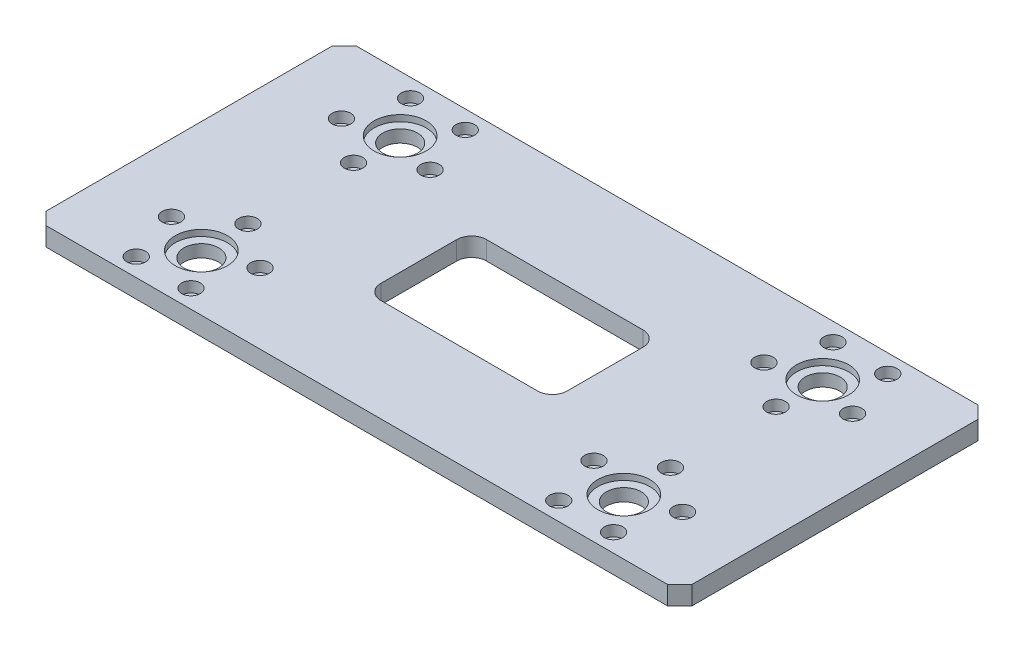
from build123d import *

# Parameters (mm, degrees)
SKETCH1_W                                           = 520
SKETCH1_H                                           = 250
BOSS_EXTRUDE1_DEPTH                                 = 15
CHAMFER1_SIZE                                       = 10
SKETCH2_R                                           = 21
CUT_EXTRUDE1_DEPTH                                  = 5
SKETCH3_R                                           = 14
CUT_EXTRUDE2_DEPTH                                  = 289.660700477
CBORE_FOR_M8_HEX_SOCKET_HEAD_CAP_SCREW1_D           = 9
CBORE_FOR_M8_HEX_SOCKET_HEAD_CAP_SCREW1_CBORE_D     = 15
CBORE_FOR_M8_HEX_SOCKET_HEAD_CAP_SCREW1_CBORE_DEPTH = 8.6
CIRPATTERN1_COUNT                                   = 5
MIRROR1_COPY_1_D                                    = 9
MIRROR1_COPY_1_CBORE_D                              = 15
MIRROR1_COPY_1_CBORE_DEPTH                          = 8.6
MIRROR1_COPY_2_D                                    = 9
MIRROR1_COPY_2_CBORE_D                              = 15
MIRROR1_COPY_2_CBORE_DEPTH                          = 8.6
MIRROR1_COPY_3_D                                    = 9
MIRROR1_COPY_3_CBORE_D                              = 15
MIRROR1_COPY_3_CBORE_DEPTH                          = 8.6
MIRROR1_COPY_4_D                                    = 9
MIRROR1_COPY_4_CBORE_D                              = 15
MIRROR1_COPY_4_CBORE_DEPTH                          = 8.6
MIRROR2_COPY_1_D                                    = 9
MIRROR2_COPY_1_CBORE_D                              = 15
MIRROR2_COPY_1_CBORE_DEPTH                          = 8.6
MIRROR2_COPY_2_D                                    = 9
MIRROR2_COPY_2_CBORE_D                              = 15
MIRROR2_COPY_2_CBORE_DEPTH                          = 8.6
MIRROR2_COPY_3_D                                    = 9
MIRROR2_COPY_3_CBORE_D                              = 15
MIRROR2_COPY_3_CBORE_DEPTH                          = 8.6
MIRROR2_COPY_4_D                                    = 9
MIRROR2_COPY_4_CBORE_D                              = 15
MIRROR2_COPY_4_CBORE_DEPTH                          = 8.6
MIRROR2_COPY_5_SKETCH_R                             = 21
MIRROR2_COPY_5_DEPTH                                = 5
MIRROR2_COPY_6_SKETCH_R                             = 14
MIRROR2_COPY_6_DEPTH                                = 289.660700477
MIRROR2_COPY_7_D                                    = 9
MIRROR2_COPY_7_CBORE_D                              = 15
MIRROR2_COPY_7_CBORE_DEPTH                          = 8.6
MIRROR2_COPY_8_D                                    = 9
MIRROR2_COPY_8_CBORE_D                              = 15
MIRROR2_COPY_8_CBORE_DEPTH                          = 8.6
MIRROR2_COPY_9_D                                    = 9
MIRROR2_COPY_9_CBORE_D                              = 15
MIRROR2_COPY_9_CBORE_DEPTH                          = 8.6
MIRROR2_COPY_10_D                                   = 9
MIRROR2_COPY_10_CBORE_D                             = 15
MIRROR2_COPY_10_CBORE_DEPTH                         = 8.6
MIRROR2_COPY_11_D                                   = 9
MIRROR2_COPY_11_CBORE_D                             = 15
MIRROR2_COPY_11_CBORE_DEPTH                         = 8.6
SKETCH6_W                                           = 150
SKETCH6_H                                           = 85
CUT_EXTRUDE7_DEPTH                                  = 289.877136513
FILLET1_R                                           = 12


with BuildPart() as part:
    # Sketch1 → Boss-Extrude1 (new body)
    with BuildSketch(Plane(origin=(0, 0, 0), x_dir=(1, 0, 0), z_dir=(0, 1, 0))):
        Rectangle(SKETCH1_W, SKETCH1_H)
    extrude(amount=BOSS_EXTRUDE1_DEPTH)

    # Chamfer1
    chamfer1_edges = [part.edges().sort_by_distance(p)[0] for p in [
        (-260, 7.5, -125),
        (260, 7.5, -125),
        (260, 7.5, 125),
        (-260, 7.5, 125),
    ]]
    chamfer(chamfer1_edges, length=CHAMFER1_SIZE)

    # Sketch2 → Cut-Extrude1 (cut)
    with BuildSketch(Plane(origin=(0, 15, 0), x_dir=(1, 0, 0), z_dir=(0, 1, 0))):
        with Locations(Location((170, -80, 0), (0, 0, 270))):
            Circle(SKETCH2_R)
    cut_extrude1 = extrude(amount=-CUT_EXTRUDE1_DEPTH, mode=Mode.SUBTRACT)

    # Sketch3 → Cut-Extrude2 (cut, through all)
    with BuildSketch(Plane(origin=(0, 10, 0), x_dir=(1, 0, 0), z_dir=(0, 1, 0))):
        with Locations(Location((170, -80, 0), (0, 0, 270))):
            Circle(SKETCH3_R)
    cut_extrude2 = extrude(amount=-CUT_EXTRUDE2_DEPTH, mode=Mode.SUBTRACT)

    # CBORE for M8 Hex Socket Head Cap Screw1 (through all)
    with Locations(Plane(origin=(0, 15, 0), x_dir=(1, 0, 0), z_dir=(0, 1, 0))):
        with Locations((170, -42.5)):
            cbore_for_m8_hex_socket_head_cap_screw1 = CounterBoreHole(CBORE_FOR_M8_HEX_SOCKET_HEAD_CAP_SCREW1_D / 2, CBORE_FOR_M8_HEX_SOCKET_HEAD_CAP_SCREW1_CBORE_D / 2, CBORE_FOR_M8_HEX_SOCKET_HEAD_CAP_SCREW1_CBORE_DEPTH)

    # CirPattern1: CBORE for M8 Hex Socket Head Cap Screw1 ×5 about axis
    cirpattern1_axis = Axis((170, 0, 80), (0, 1, 0))
    for i in range(1, CIRPATTERN1_COUNT):
        add(cbore_for_m8_hex_socket_head_cap_screw1.rotate(cirpattern1_axis, i * 360 / CIRPATTERN1_COUNT), mode=Mode.SUBTRACT)

    # Mirror1: Cut-Extrude1, Cut-Extrude2, CBORE for M8 Hex Socket Head Cap Screw1 across plane
    add(cut_extrude1.mirror(Plane.XY), mode=Mode.SUBTRACT)
    add(cut_extrude2.mirror(Plane.XY), mode=Mode.SUBTRACT)
    add(cbore_for_m8_hex_socket_head_cap_screw1.mirror(Plane.XY), mode=Mode.SUBTRACT)

    # Mirror1 copy 1 (through all)
    with Locations(Plane(origin=(41.382589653, 15, -216.95824822), x_dir=(0.30901699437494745, 0, 0.9510565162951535), z_dir=(0, 1, 0))):
        with Locations((170, 42.5)):
            CounterBoreHole(MIRROR1_COPY_1_D / 2, MIRROR1_COPY_1_CBORE_D / 2, MIRROR1_COPY_1_CBORE_DEPTH)

    # Mirror1 copy 2 (through all)
    with Locations(Plane(origin=(260.51006886, 15, -244.64485244), x_dir=(-0.8090169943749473, 0, 0.5877852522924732), z_dir=(0, 1, 0))):
        with Locations((170, 42.5)):
            CounterBoreHole(MIRROR1_COPY_2_D / 2, MIRROR1_COPY_2_CBORE_D / 2, MIRROR1_COPY_2_CBORE_DEPTH)

    # Mirror1 copy 3 (through all)
    with Locations(Plane(origin=(354.555709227, 15, -44.79786666), x_dir=(-0.8090169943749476, 0, -0.587785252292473), z_dir=(0, 1, 0))):
        with Locations((170, 42.5)):
            CounterBoreHole(MIRROR1_COPY_3_D / 2, MIRROR1_COPY_3_CBORE_D / 2, MIRROR1_COPY_3_CBORE_DEPTH)

    # Mirror1 copy 4 (through all)
    with Locations(Plane(origin=(193.55163226, 15, 106.40096732), x_dir=(0.30901699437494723, 0, -0.9510565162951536), z_dir=(0, 1, 0))):
        with Locations((170, 42.5)):
            CounterBoreHole(MIRROR1_COPY_4_D / 2, MIRROR1_COPY_4_CBORE_D / 2, MIRROR1_COPY_4_CBORE_DEPTH)

    # Mirror2: Cut-Extrude1, Cut-Extrude2, CBORE for M8 Hex Socket Head Cap Screw1 across plane
    add(cut_extrude1.mirror(Plane(origin=(0, 0, 0), x_dir=(0, 0, 1), z_dir=(1, 0, 0))), mode=Mode.SUBTRACT)
    add(cut_extrude2.mirror(Plane(origin=(0, 0, 0), x_dir=(0, 0, 1), z_dir=(1, 0, 0))), mode=Mode.SUBTRACT)
    add(cbore_for_m8_hex_socket_head_cap_screw1.mirror(Plane(origin=(0, 0, 0), x_dir=(0, 0, 1), z_dir=(1, 0, 0))), mode=Mode.SUBTRACT)

    # Mirror2 copy 1 (through all)
    with Locations(Plane(origin=(-41.382589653, 15, 216.95824822), x_dir=(-0.30901699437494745, 0, -0.9510565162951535), z_dir=(0, 1, 0))):
        with Locations((170, 42.5)):
            CounterBoreHole(MIRROR2_COPY_1_D / 2, MIRROR2_COPY_1_CBORE_D / 2, MIRROR2_COPY_1_CBORE_DEPTH)

    # Mirror2 copy 2 (through all)
    with Locations(Plane(origin=(-260.51006886, 15, 244.64485244), x_dir=(0.8090169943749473, 0, -0.5877852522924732), z_dir=(0, 1, 0))):
        with Locations((170, 42.5)):
            CounterBoreHole(MIRROR2_COPY_2_D / 2, MIRROR2_COPY_2_CBORE_D / 2, MIRROR2_COPY_2_CBORE_DEPTH)

    # Mirror2 copy 3 (through all)
    with Locations(Plane(origin=(-354.555709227, 15, 44.79786666), x_dir=(0.8090169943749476, 0, 0.587785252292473), z_dir=(0, 1, 0))):
        with Locations((170, 42.5)):
            CounterBoreHole(MIRROR2_COPY_3_D / 2, MIRROR2_COPY_3_CBORE_D / 2, MIRROR2_COPY_3_CBORE_DEPTH)

    # Mirror2 copy 4 (through all)
    with Locations(Plane(origin=(-193.55163226, 15, -106.40096732), x_dir=(-0.30901699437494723, 0, 0.9510565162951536), z_dir=(0, 1, 0))):
        with Locations((170, 42.5)):
            CounterBoreHole(MIRROR2_COPY_4_D / 2, MIRROR2_COPY_4_CBORE_D / 2, MIRROR2_COPY_4_CBORE_DEPTH)

    # Mirror2 copy 5 sketch → Mirror2 copy 5 (cut)
    with BuildSketch(Plane(origin=(0, 15, 0), x_dir=(-1, 0, 0), z_dir=(0, 1, 0))):
        with Locations(Location((170, -80, 0), (0, 0, 270))):
            Circle(MIRROR2_COPY_5_SKETCH_R)
    extrude(amount=-MIRROR2_COPY_5_DEPTH, mode=Mode.SUBTRACT)

    # Mirror2 copy 6 sketch → Mirror2 copy 6 (cut, through all)
    with BuildSketch(Plane(origin=(0, 10, 0), x_dir=(-1, 0, 0), z_dir=(0, 1, 0))):
        with Locations(Location((170, -80, 0), (0, 0, 270))):
            Circle(MIRROR2_COPY_6_SKETCH_R)
    extrude(amount=-MIRROR2_COPY_6_DEPTH, mode=Mode.SUBTRACT)

    # Mirror2 copy 7 (through all)
    with Locations(Plane(origin=(0, 15, 0), x_dir=(-1, 0, 0), z_dir=(0, 1, 0))):
        with Locations((170, -42.5)):
            CounterBoreHole(MIRROR2_COPY_7_D / 2, MIRROR2_COPY_7_CBORE_D / 2, MIRROR2_COPY_7_CBORE_DEPTH)

    # Mirror2 copy 8 (through all)
    with Locations(Plane(origin=(-41.382589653, 15, -216.95824822), x_dir=(-0.30901699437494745, 0, 0.9510565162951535), z_dir=(0, 1, 0))):
        with Locations((170, -42.5)):
            CounterBoreHole(MIRROR2_COPY_8_D / 2, MIRROR2_COPY_8_CBORE_D / 2, MIRROR2_COPY_8_CBORE_DEPTH)

    # Mirror2 copy 9 (through all)
    with Locations(Plane(origin=(-260.51006886, 15, -244.64485244), x_dir=(0.8090169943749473, 0, 0.5877852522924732), z_dir=(0, 1, 0))):
        with Locations((170, -42.5)):
            CounterBoreHole(MIRROR2_COPY_9_D / 2, MIRROR2_COPY_9_CBORE_D / 2, MIRROR2_COPY_9_CBORE_DEPTH)

    # Mirror2 copy 10 (through all)
    with Locations(Plane(origin=(-354.555709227, 15, -44.79786666), x_dir=(0.8090169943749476, 0, -0.587785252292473), z_dir=(0, 1, 0))):
        with Locations((170, -42.5)):
            CounterBoreHole(MIRROR2_COPY_10_D / 2, MIRROR2_COPY_10_CBORE_D / 2, MIRROR2_COPY_10_CBORE_DEPTH)

    # Mirror2 copy 11 (through all)
    with Locations(Plane(origin=(-193.55163226, 15, 106.40096732), x_dir=(-0.30901699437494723, 0, -0.9510565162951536), z_dir=(0, 1, 0))):
        with Locations((170, -42.5)):
            CounterBoreHole(MIRROR2_COPY_11_D / 2, MIRROR2_COPY_11_CBORE_D / 2, MIRROR2_COPY_11_CBORE_DEPTH)

    # Sketch6 → Cut-Extrude7 (cut, through all)
    with BuildSketch(Plane(origin=(0, 0, 0), x_dir=(1, 0, 0), z_dir=(0, 1, 0))):
        Rectangle(SKETCH6_W, SKETCH6_H)
    extrude(amount=CUT_EXTRUDE7_DEPTH, mode=Mode.SUBTRACT)

    # Fillet1
    fillet1_edges = [part.edges().sort_by_distance(p)[0] for p in [
        (75, 7.5, 42.5),
        (75, 7.5, -42.5),
        (-75, 7.5, -42.5),
        (-75, 7.5, 42.5),
    ]]
    fillet(fillet1_edges, radius=FILLET1_R)


solid = part.part
